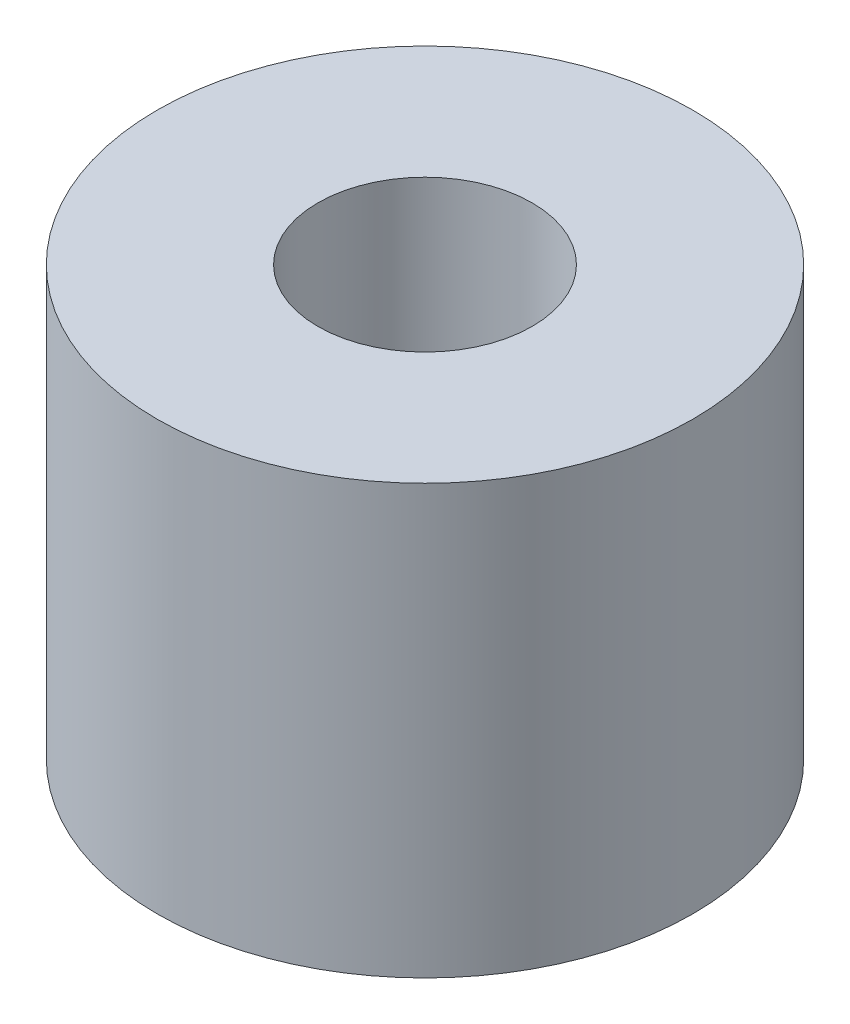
from build123d import *

# Parameters (mm, degrees)
SKETCH1_R          = 12.5
SKETCH1_R_2        = 5
EXTRUDE1_DEPTH     = 20
SKETCH2_R          = 2
CUT_EXTRUDE1_DEPTH = 20


with BuildPart() as part:
    # Sketch1 → Extrude1 (new body)
    with BuildSketch(Plane(origin=(0, 0, 0), x_dir=(1, 0, 0), z_dir=(0, 1, 0))):
        with Locations(Location((0, 0, 0), (0, 0, 270))):
            Circle(SKETCH1_R)
        with Locations(Location((0, 0, 0), (0, 0, 270))):
            Circle(SKETCH1_R_2, mode=Mode.SUBTRACT)
    extrude(amount=EXTRUDE1_DEPTH)

    # Sketch2 → Cut-Extrude1 (cut)
    with BuildSketch(Plane.XY):
        with Locations(Location((0, 10, 0), (0, 0, 90))):
            Circle(SKETCH2_R)
    extrude(amount=-CUT_EXTRUDE1_DEPTH, mode=Mode.SUBTRACT)


solid = part.part
